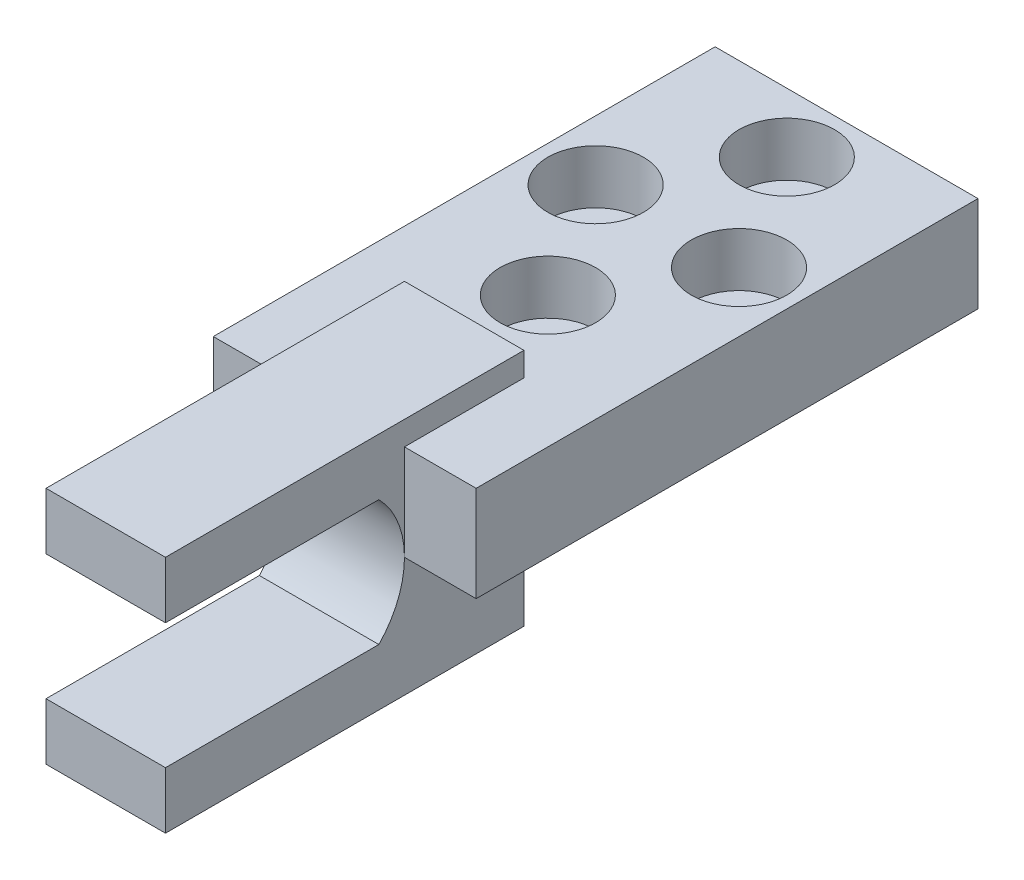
ISO-10303-21;
HEADER;
FILE_DESCRIPTION(('STEP AP214'),'2;1');
FILE_NAME('part.step','',(''),(''),'','','');
FILE_SCHEMA(('AUTOMOTIVE_DESIGN { 1 0 10303 214 1 1 1 1 }'));
ENDSEC;
DATA;
#1=APPLICATION_CONTEXT('core data for automotive mechanical design processes');
#2=APPLICATION_PROTOCOL_DEFINITION('international standard','automotive_design',2000,#1);
#3=PRODUCT_CONTEXT('',#1,'mechanical');
#4=PRODUCT('Part','Part','',(#3));
#5=PRODUCT_RELATED_PRODUCT_CATEGORY('part','',(#4));
#6=PRODUCT_DEFINITION_FORMATION('','',#4);
#7=PRODUCT_DEFINITION_CONTEXT('part definition',#1,'design');
#8=PRODUCT_DEFINITION('design','',#6,#7);
#9=PRODUCT_DEFINITION_SHAPE('','',#8);
#10=(LENGTH_UNIT() NAMED_UNIT(*) SI_UNIT(.MILLI.,.METRE.));
#11=(NAMED_UNIT(*) PLANE_ANGLE_UNIT() SI_UNIT($,.RADIAN.));
#12=(NAMED_UNIT(*) SI_UNIT($,.STERADIAN.) SOLID_ANGLE_UNIT());
#13=UNCERTAINTY_MEASURE_WITH_UNIT(LENGTH_MEASURE(1.E-05),#10,'distance_accuracy_value','');
#14=(GEOMETRIC_REPRESENTATION_CONTEXT(3) GLOBAL_UNCERTAINTY_ASSIGNED_CONTEXT((#13)) GLOBAL_UNIT_ASSIGNED_CONTEXT((#10,
#11,#12)) REPRESENTATION_CONTEXT('',''));
#15=CARTESIAN_POINT('',(0.,0.,0.));
#16=DIRECTION('',(0.,0.,1.));
#17=DIRECTION('',(1.,0.,0.));
#18=AXIS2_PLACEMENT_3D('',#15,#16,#17);
#19=CARTESIAN_POINT('',(17.,-44.0000000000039,15.));
#20=DIRECTION('',(0.,1.,0.));
#21=DIRECTION('',(-1.,0.,0.));
#22=AXIS2_PLACEMENT_3D('',#19,#20,#21);
#23=CYLINDRICAL_SURFACE('',#22,2.25);
#24=CARTESIAN_POINT('',(17.,9.99999999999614,15.));
#25=DIRECTION('',(0.,1.,0.));
#26=DIRECTION('',(0.,0.,1.));
#27=AXIS2_PLACEMENT_3D('',#24,#25,#26);
#28=CIRCLE('',#27,2.25);
#29=CARTESIAN_POINT('',(17.,9.99999999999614,17.25));
#30=VERTEX_POINT('',#29);
#31=EDGE_CURVE('E184',#30,#30,#28,.T.);
#32=ORIENTED_EDGE('',*,*,#31,.F.);
#33=EDGE_LOOP('',(#32));
#34=FACE_BOUND('',#33,.T.);
#35=CARTESIAN_POINT('',(17.,13.4999999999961,15.));
#36=DIRECTION('',(0.,1.,0.));
#37=DIRECTION('',(-1.,0.,0.));
#38=AXIS2_PLACEMENT_3D('',#35,#36,#37);
#39=CIRCLE('',#38,2.25);
#40=CARTESIAN_POINT('',(14.75,13.4999999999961,15.));
#41=VERTEX_POINT('',#40);
#42=EDGE_CURVE('E196',#41,#41,#39,.F.);
#43=ORIENTED_EDGE('',*,*,#42,.F.);
#44=EDGE_LOOP('',(#43));
#45=FACE_BOUND('',#44,.T.);
#46=ADVANCED_FACE('F33',(#34,#45),#23,.F.);
#47=CARTESIAN_POINT('',(4.99999999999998,-44.0000000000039,15.));
#48=DIRECTION('',(0.,1.,0.));
#49=DIRECTION('',(-1.,0.,0.));
#50=AXIS2_PLACEMENT_3D('',#47,#48,#49);
#51=CYLINDRICAL_SURFACE('',#50,2.25);
#52=CARTESIAN_POINT('',(5.00000000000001,9.99999999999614,15.));
#53=DIRECTION('',(0.,1.,0.));
#54=DIRECTION('',(0.,0.,1.));
#55=AXIS2_PLACEMENT_3D('',#52,#53,#54);
#56=CIRCLE('',#55,2.25);
#57=CARTESIAN_POINT('',(5.00000000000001,9.99999999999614,17.25));
#58=VERTEX_POINT('',#57);
#59=EDGE_CURVE('E330',#58,#58,#56,.T.);
#60=ORIENTED_EDGE('',*,*,#59,.F.);
#61=EDGE_LOOP('',(#60));
#62=FACE_BOUND('',#61,.T.);
#63=CARTESIAN_POINT('',(5.00000000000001,13.4999999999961,15.));
#64=DIRECTION('',(0.,1.,0.));
#65=DIRECTION('',(-1.,0.,0.));
#66=AXIS2_PLACEMENT_3D('',#63,#64,#65);
#67=CIRCLE('',#66,2.25);
#68=CARTESIAN_POINT('',(2.75000000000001,13.4999999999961,15.));
#69=VERTEX_POINT('',#68);
#70=EDGE_CURVE('E191',#69,#69,#67,.F.);
#71=ORIENTED_EDGE('',*,*,#70,.F.);
#72=EDGE_LOOP('',(#71));
#73=FACE_BOUND('',#72,.T.);
#74=ADVANCED_FACE('F389',(#62,#73),#51,.F.);
#75=CARTESIAN_POINT('',(11.,-44.0000000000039,25.));
#76=DIRECTION('',(0.,1.,0.));
#77=DIRECTION('',(-1.,0.,0.));
#78=AXIS2_PLACEMENT_3D('',#75,#76,#77);
#79=CYLINDRICAL_SURFACE('',#78,2.25);
#80=CARTESIAN_POINT('',(11.,9.99999999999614,25.));
#81=DIRECTION('',(0.,1.,0.));
#82=DIRECTION('',(0.,0.,1.));
#83=AXIS2_PLACEMENT_3D('',#80,#81,#82);
#84=CIRCLE('',#83,2.25);
#85=CARTESIAN_POINT('',(11.,9.99999999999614,27.25));
#86=VERTEX_POINT('',#85);
#87=EDGE_CURVE('E327',#86,#86,#84,.T.);
#88=ORIENTED_EDGE('',*,*,#87,.F.);
#89=EDGE_LOOP('',(#88));
#90=FACE_BOUND('',#89,.T.);
#91=CARTESIAN_POINT('',(11.,13.4999999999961,25.));
#92=DIRECTION('',(0.,1.,0.));
#93=DIRECTION('',(-1.,0.,0.));
#94=AXIS2_PLACEMENT_3D('',#91,#92,#93);
#95=CIRCLE('',#94,2.25);
#96=CARTESIAN_POINT('',(8.75000000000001,13.4999999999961,25.));
#97=VERTEX_POINT('',#96);
#98=EDGE_CURVE('E186',#97,#97,#95,.F.);
#99=ORIENTED_EDGE('',*,*,#98,.F.);
#100=EDGE_LOOP('',(#99));
#101=FACE_BOUND('',#100,.T.);
#102=ADVANCED_FACE('F395',(#90,#101),#79,.F.);
#103=CARTESIAN_POINT('',(11.,-44.0000000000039,5.));
#104=DIRECTION('',(0.,1.,0.));
#105=DIRECTION('',(-1.,0.,0.));
#106=AXIS2_PLACEMENT_3D('',#103,#104,#105);
#107=CYLINDRICAL_SURFACE('',#106,2.25);
#108=CARTESIAN_POINT('',(11.,9.99999999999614,5.));
#109=DIRECTION('',(0.,1.,0.));
#110=DIRECTION('',(0.,0.,1.));
#111=AXIS2_PLACEMENT_3D('',#108,#109,#110);
#112=CIRCLE('',#111,2.25);
#113=CARTESIAN_POINT('',(11.,9.99999999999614,7.25));
#114=VERTEX_POINT('',#113);
#115=EDGE_CURVE('E273',#114,#114,#112,.T.);
#116=ORIENTED_EDGE('',*,*,#115,.F.);
#117=EDGE_LOOP('',(#116));
#118=FACE_BOUND('',#117,.T.);
#119=CARTESIAN_POINT('',(11.,13.4999999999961,5.));
#120=DIRECTION('',(0.,1.,0.));
#121=DIRECTION('',(-1.,0.,0.));
#122=AXIS2_PLACEMENT_3D('',#119,#120,#121);
#123=CIRCLE('',#122,2.25);
#124=CARTESIAN_POINT('',(8.75000000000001,13.4999999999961,5.));
#125=VERTEX_POINT('',#124);
#126=EDGE_CURVE('E181',#125,#125,#123,.F.);
#127=ORIENTED_EDGE('',*,*,#126,.F.);
#128=EDGE_LOOP('',(#127));
#129=FACE_BOUND('',#128,.T.);
#130=ADVANCED_FACE('F406',(#118,#129),#107,.F.);
#131=CARTESIAN_POINT('',(16.,17.9999999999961,62.));
#132=DIRECTION('',(-1.,0.,0.));
#133=DIRECTION('',(0.,0.,1.));
#134=AXIS2_PLACEMENT_3D('',#131,#132,#133);
#135=PLANE('',#134);
#136=DIRECTION('',(0.,-1.,0.));
#137=VECTOR('',#136,1.);
#138=CARTESIAN_POINT('',(16.,17.9999999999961,31.9999999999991));
#139=LINE('',#138,#137);
#140=CARTESIAN_POINT('',(16.,19.9999999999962,31.9999999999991));
#141=VERTEX_POINT('',#140);
#142=CARTESIAN_POINT('',(16.,17.9999999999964,31.9999999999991));
#143=VERTEX_POINT('',#142);
#144=EDGE_CURVE('E230',#141,#143,#139,.T.);
#145=ORIENTED_EDGE('',*,*,#144,.F.);
#146=DIRECTION('',(0.,0.,-1.));
#147=VECTOR('',#146,1.);
#148=CARTESIAN_POINT('',(16.,19.999999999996,62.));
#149=LINE('',#148,#147);
#150=CARTESIAN_POINT('',(16.,19.999999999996,62.));
#151=VERTEX_POINT('',#150);
#152=EDGE_CURVE('E170',#151,#141,#149,.T.);
#153=ORIENTED_EDGE('',*,*,#152,.F.);
#154=DIRECTION('',(0.,1.,0.));
#155=VECTOR('',#154,1.);
#156=CARTESIAN_POINT('',(16.,17.9999999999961,62.));
#157=LINE('',#156,#155);
#158=CARTESIAN_POINT('',(16.,15.25,62.));
#159=VERTEX_POINT('',#158);
#160=EDGE_CURVE('E47',#159,#151,#157,.T.);
#161=ORIENTED_EDGE('',*,*,#160,.F.);
#162=DIRECTION('',(0.,0.,-1.));
#163=VECTOR('',#162,1.);
#164=CARTESIAN_POINT('',(16.,15.25,61.9999999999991));
#165=LINE('',#164,#163);
#166=CARTESIAN_POINT('',(16.,15.25,44.1439286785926));
#167=VERTEX_POINT('',#166);
#168=EDGE_CURVE('E12',#159,#167,#165,.T.);
#169=ORIENTED_EDGE('',*,*,#168,.T.);
#170=CARTESIAN_POINT('',(16.,10.,49.4999999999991));
#171=DIRECTION('',(-1.,0.,0.));
#172=DIRECTION('',(0.,0.,1.));
#173=AXIS2_PLACEMENT_3D('',#170,#171,#172);
#174=CIRCLE('',#173,7.49999999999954);
#175=CARTESIAN_POINT('',(16.,10.,41.9999999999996));
#176=VERTEX_POINT('',#175);
#177=EDGE_CURVE('E163',#167,#176,#174,.T.);
#178=ORIENTED_EDGE('',*,*,#177,.T.);
#179=DIRECTION('',(0.,-1.,0.));
#180=VECTOR('',#179,1.);
#181=CARTESIAN_POINT('',(16.,19.9999999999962,41.9999999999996));
#182=LINE('',#181,#180);
#183=CARTESIAN_POINT('',(16.,17.9999999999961,41.9999999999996));
#184=VERTEX_POINT('',#183);
#185=EDGE_CURVE('E150',#184,#176,#182,.T.);
#186=ORIENTED_EDGE('',*,*,#185,.F.);
#187=DIRECTION('',(0.,0.,-1.));
#188=VECTOR('',#187,1.);
#189=CARTESIAN_POINT('',(16.,17.9999999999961,62.));
#190=LINE('',#189,#188);
#191=EDGE_CURVE('E160',#184,#143,#190,.T.);
#192=ORIENTED_EDGE('',*,*,#191,.T.);
#193=EDGE_LOOP('',(#145,#153,#161,#169,#178,#186,#192));
#194=FACE_BOUND('',#193,.T.);
#195=ADVANCED_FACE('F35',(#194),#135,.F.);
#196=CARTESIAN_POINT('',(6.,19.999999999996,62.));
#197=DIRECTION('',(0.,-1.,0.));
#198=DIRECTION('',(0.,0.,-1.));
#199=AXIS2_PLACEMENT_3D('',#196,#197,#198);
#200=PLANE('',#199);
#201=DIRECTION('',(1.,0.,0.));
#202=VECTOR('',#201,1.);
#203=CARTESIAN_POINT('',(-40.,19.9999999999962,31.9999999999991));
#204=LINE('',#203,#202);
#205=CARTESIAN_POINT('',(6.,19.9999999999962,31.9999999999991));
#206=VERTEX_POINT('',#205);
#207=EDGE_CURVE('E265',#206,#141,#204,.T.);
#208=ORIENTED_EDGE('',*,*,#207,.F.);
#209=DIRECTION('',(0.,0.,-1.));
#210=VECTOR('',#209,1.);
#211=CARTESIAN_POINT('',(6.,19.999999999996,62.));
#212=LINE('',#211,#210);
#213=CARTESIAN_POINT('',(6.,19.999999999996,62.));
#214=VERTEX_POINT('',#213);
#215=EDGE_CURVE('E175',#214,#206,#212,.T.);
#216=ORIENTED_EDGE('',*,*,#215,.F.);
#217=DIRECTION('',(-1.,0.,0.));
#218=VECTOR('',#217,1.);
#219=CARTESIAN_POINT('',(6.,19.999999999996,62.));
#220=LINE('',#219,#218);
#221=EDGE_CURVE('E212',#151,#214,#220,.T.);
#222=ORIENTED_EDGE('',*,*,#221,.F.);
#223=ORIENTED_EDGE('',*,*,#152,.T.);
#224=EDGE_LOOP('',(#208,#216,#222,#223));
#225=FACE_BOUND('',#224,.T.);
#226=ADVANCED_FACE('F268',(#225),#200,.F.);
#227=CARTESIAN_POINT('',(6.,17.9999999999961,62.));
#228=DIRECTION('',(1.,0.,0.));
#229=DIRECTION('',(0.,1.,0.));
#230=AXIS2_PLACEMENT_3D('',#227,#228,#229);
#231=PLANE('',#230);
#232=DIRECTION('',(0.,0.,-1.));
#233=VECTOR('',#232,1.);
#234=CARTESIAN_POINT('',(6.,17.9999999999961,62.));
#235=LINE('',#234,#233);
#236=CARTESIAN_POINT('',(6.,17.9999999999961,41.9999999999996));
#237=VERTEX_POINT('',#236);
#238=CARTESIAN_POINT('',(6.,17.9999999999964,31.9999999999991));
#239=VERTEX_POINT('',#238);
#240=EDGE_CURVE('E256',#237,#239,#235,.T.);
#241=ORIENTED_EDGE('',*,*,#240,.F.);
#242=DIRECTION('',(0.,-1.,0.));
#243=VECTOR('',#242,1.);
#244=CARTESIAN_POINT('',(6.,19.9999999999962,41.9999999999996));
#245=LINE('',#244,#243);
#246=CARTESIAN_POINT('',(6.,10.,41.9999999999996));
#247=VERTEX_POINT('',#246);
#248=EDGE_CURVE('E157',#237,#247,#245,.T.);
#249=ORIENTED_EDGE('',*,*,#248,.T.);
#250=CARTESIAN_POINT('',(6.,10.,49.4999999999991));
#251=DIRECTION('',(1.,0.,0.));
#252=DIRECTION('',(0.,0.,-1.));
#253=AXIS2_PLACEMENT_3D('',#250,#251,#252);
#254=CIRCLE('',#253,7.49999999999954);
#255=CARTESIAN_POINT('',(6.,15.25,44.1439286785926));
#256=VERTEX_POINT('',#255);
#257=EDGE_CURVE('E55',#247,#256,#254,.T.);
#258=ORIENTED_EDGE('',*,*,#257,.T.);
#259=DIRECTION('',(0.,0.,1.));
#260=VECTOR('',#259,1.);
#261=CARTESIAN_POINT('',(6.,15.25,61.9999999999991));
#262=LINE('',#261,#260);
#263=CARTESIAN_POINT('',(6.,15.25,62.));
#264=VERTEX_POINT('',#263);
#265=EDGE_CURVE('E41',#256,#264,#262,.T.);
#266=ORIENTED_EDGE('',*,*,#265,.T.);
#267=DIRECTION('',(0.,-1.,0.));
#268=VECTOR('',#267,1.);
#269=CARTESIAN_POINT('',(6.,17.9999999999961,62.));
#270=LINE('',#269,#268);
#271=EDGE_CURVE('E204',#214,#264,#270,.T.);
#272=ORIENTED_EDGE('',*,*,#271,.F.);
#273=ORIENTED_EDGE('',*,*,#215,.T.);
#274=DIRECTION('',(0.,1.,0.));
#275=VECTOR('',#274,1.);
#276=CARTESIAN_POINT('',(6.,17.9999999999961,31.9999999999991));
#277=LINE('',#276,#275);
#278=EDGE_CURVE('E259',#239,#206,#277,.T.);
#279=ORIENTED_EDGE('',*,*,#278,.F.);
#280=EDGE_LOOP('',(#241,#249,#258,#266,#272,#273,#279));
#281=FACE_BOUND('',#280,.T.);
#282=ADVANCED_FACE('F203',(#281),#231,.F.);
#283=CARTESIAN_POINT('',(0.,9.99999999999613,62.));
#284=DIRECTION('',(1.,0.,0.));
#285=DIRECTION('',(0.,0.,-1.));
#286=AXIS2_PLACEMENT_3D('',#283,#284,#285);
#287=PLANE('',#286);
#288=DIRECTION('',(0.,0.,-1.));
#289=VECTOR('',#288,1.);
#290=CARTESIAN_POINT('',(0.,9.99999999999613,62.));
#291=LINE('',#290,#289);
#292=CARTESIAN_POINT('',(0.,10.,41.9999999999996));
#293=VERTEX_POINT('',#292);
#294=CARTESIAN_POINT('',(0.,9.99999999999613,0.));
#295=VERTEX_POINT('',#294);
#296=EDGE_CURVE('E252',#293,#295,#291,.T.);
#297=ORIENTED_EDGE('',*,*,#296,.F.);
#298=DIRECTION('',(0.,1.,0.));
#299=VECTOR('',#298,1.);
#300=CARTESIAN_POINT('',(0.,9.99999999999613,41.9999999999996));
#301=LINE('',#300,#299);
#302=CARTESIAN_POINT('',(0.,17.9999999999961,41.9999999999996));
#303=VERTEX_POINT('',#302);
#304=EDGE_CURVE('E355',#293,#303,#301,.T.);
#305=ORIENTED_EDGE('',*,*,#304,.T.);
#306=DIRECTION('',(0.,0.,-1.));
#307=VECTOR('',#306,1.);
#308=CARTESIAN_POINT('',(0.,17.9999999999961,62.));
#309=LINE('',#308,#307);
#310=CARTESIAN_POINT('',(0.,17.9999999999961,0.));
#311=VERTEX_POINT('',#310);
#312=EDGE_CURVE('E254',#303,#311,#309,.T.);
#313=ORIENTED_EDGE('',*,*,#312,.T.);
#314=DIRECTION('',(0.,-1.,0.));
#315=VECTOR('',#314,1.);
#316=CARTESIAN_POINT('',(0.,9.99999999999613,0.));
#317=LINE('',#316,#315);
#318=EDGE_CURVE('E229',#311,#295,#317,.T.);
#319=ORIENTED_EDGE('',*,*,#318,.T.);
#320=EDGE_LOOP('',(#297,#305,#313,#319));
#321=FACE_BOUND('',#320,.T.);
#322=ADVANCED_FACE('F373',(#321),#287,.F.);
#323=CARTESIAN_POINT('',(6.,-2.27373675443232E-13,62.));
#324=DIRECTION('',(1.,0.,0.));
#325=DIRECTION('',(0.,0.,-1.));
#326=AXIS2_PLACEMENT_3D('',#323,#324,#325);
#327=PLANE('',#326);
#328=DIRECTION('',(0.,1.,0.));
#329=VECTOR('',#328,1.);
#330=CARTESIAN_POINT('',(6.,-2.27373675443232E-13,31.9999999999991));
#331=LINE('',#330,#329);
#332=CARTESIAN_POINT('',(6.,0.,31.9999999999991));
#333=VERTEX_POINT('',#332);
#334=CARTESIAN_POINT('',(6.,9.99999999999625,31.9999999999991));
#335=VERTEX_POINT('',#334);
#336=EDGE_CURVE('E266',#333,#335,#331,.T.);
#337=ORIENTED_EDGE('',*,*,#336,.F.);
#338=DIRECTION('',(0.,0.,-1.));
#339=VECTOR('',#338,1.);
#340=CARTESIAN_POINT('',(6.,-2.27373675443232E-13,62.));
#341=LINE('',#340,#339);
#342=CARTESIAN_POINT('',(6.,-2.27373675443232E-13,62.));
#343=VERTEX_POINT('',#342);
#344=EDGE_CURVE('E247',#343,#333,#341,.T.);
#345=ORIENTED_EDGE('',*,*,#344,.F.);
#346=DIRECTION('',(0.,-1.,0.));
#347=VECTOR('',#346,1.);
#348=CARTESIAN_POINT('',(6.,-2.27373675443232E-13,62.));
#349=LINE('',#348,#347);
#350=CARTESIAN_POINT('',(6.,4.75,61.9999999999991));
#351=VERTEX_POINT('',#350);
#352=EDGE_CURVE('E214',#351,#343,#349,.T.);
#353=ORIENTED_EDGE('',*,*,#352,.F.);
#354=DIRECTION('',(0.,0.,1.));
#355=VECTOR('',#354,1.);
#356=CARTESIAN_POINT('',(6.,4.75,62.));
#357=LINE('',#356,#355);
#358=CARTESIAN_POINT('',(6.,4.75,44.1439286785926));
#359=VERTEX_POINT('',#358);
#360=EDGE_CURVE('E279',#359,#351,#357,.T.);
#361=ORIENTED_EDGE('',*,*,#360,.F.);
#362=CARTESIAN_POINT('',(6.,10.,49.4999999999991));
#363=DIRECTION('',(1.,0.,0.));
#364=DIRECTION('',(0.,0.,-1.));
#365=AXIS2_PLACEMENT_3D('',#362,#363,#364);
#366=CIRCLE('',#365,7.49999999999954);
#367=EDGE_CURVE('E286',#247,#359,#366,.F.);
#368=ORIENTED_EDGE('',*,*,#367,.F.);
#369=DIRECTION('',(0.,0.,-1.));
#370=VECTOR('',#369,1.);
#371=CARTESIAN_POINT('',(6.,9.99999999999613,62.));
#372=LINE('',#371,#370);
#373=EDGE_CURVE('E249',#247,#335,#372,.T.);
#374=ORIENTED_EDGE('',*,*,#373,.T.);
#375=EDGE_LOOP('',(#337,#345,#353,#361,#368,#374));
#376=FACE_BOUND('',#375,.T.);
#377=ADVANCED_FACE('F312',(#376),#327,.F.);
#378=CARTESIAN_POINT('',(6.,-2.27373675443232E-13,62.));
#379=DIRECTION('',(0.,1.,0.));
#380=DIRECTION('',(0.,0.,1.));
#381=AXIS2_PLACEMENT_3D('',#378,#379,#380);
#382=PLANE('',#381);
#383=DIRECTION('',(1.,0.,0.));
#384=VECTOR('',#383,1.);
#385=CARTESIAN_POINT('',(-40.,0.,31.9999999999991));
#386=LINE('',#385,#384);
#387=CARTESIAN_POINT('',(16.,0.,31.9999999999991));
#388=VERTEX_POINT('',#387);
#389=EDGE_CURVE('E301',#333,#388,#386,.T.);
#390=ORIENTED_EDGE('',*,*,#389,.T.);
#391=DIRECTION('',(0.,0.,-1.));
#392=VECTOR('',#391,1.);
#393=CARTESIAN_POINT('',(16.,-2.27373675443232E-13,62.));
#394=LINE('',#393,#392);
#395=CARTESIAN_POINT('',(16.,-2.27373675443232E-13,62.));
#396=VERTEX_POINT('',#395);
#397=EDGE_CURVE('E245',#396,#388,#394,.T.);
#398=ORIENTED_EDGE('',*,*,#397,.F.);
#399=DIRECTION('',(1.,0.,0.));
#400=VECTOR('',#399,1.);
#401=CARTESIAN_POINT('',(6.,-2.27373675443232E-13,62.));
#402=LINE('',#401,#400);
#403=EDGE_CURVE('E216',#343,#396,#402,.T.);
#404=ORIENTED_EDGE('',*,*,#403,.F.);
#405=ORIENTED_EDGE('',*,*,#344,.T.);
#406=EDGE_LOOP('',(#390,#398,#404,#405));
#407=FACE_BOUND('',#406,.T.);
#408=ADVANCED_FACE('F436',(#407),#382,.F.);
#409=CARTESIAN_POINT('',(16.,-2.27373675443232E-13,62.));
#410=DIRECTION('',(-1.,0.,0.));
#411=DIRECTION('',(0.,0.,1.));
#412=AXIS2_PLACEMENT_3D('',#409,#410,#411);
#413=PLANE('',#412);
#414=DIRECTION('',(0.,0.,-1.));
#415=VECTOR('',#414,1.);
#416=CARTESIAN_POINT('',(16.,9.99999999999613,62.));
#417=LINE('',#416,#415);
#418=CARTESIAN_POINT('',(16.,9.99999999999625,31.9999999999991));
#419=VERTEX_POINT('',#418);
#420=EDGE_CURVE('E242',#176,#419,#417,.T.);
#421=ORIENTED_EDGE('',*,*,#420,.F.);
#422=CARTESIAN_POINT('',(16.,10.,49.4999999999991));
#423=DIRECTION('',(-1.,0.,0.));
#424=DIRECTION('',(0.,0.,1.));
#425=AXIS2_PLACEMENT_3D('',#422,#423,#424);
#426=CIRCLE('',#425,7.49999999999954);
#427=CARTESIAN_POINT('',(16.,4.75,44.1439286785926));
#428=VERTEX_POINT('',#427);
#429=EDGE_CURVE('E284',#428,#176,#426,.F.);
#430=ORIENTED_EDGE('',*,*,#429,.F.);
#431=DIRECTION('',(0.,0.,-1.));
#432=VECTOR('',#431,1.);
#433=CARTESIAN_POINT('',(16.,4.75,62.));
#434=LINE('',#433,#432);
#435=CARTESIAN_POINT('',(16.,4.75,61.9999999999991));
#436=VERTEX_POINT('',#435);
#437=EDGE_CURVE('E277',#436,#428,#434,.T.);
#438=ORIENTED_EDGE('',*,*,#437,.F.);
#439=DIRECTION('',(0.,1.,0.));
#440=VECTOR('',#439,1.);
#441=CARTESIAN_POINT('',(16.,-2.27373675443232E-13,62.));
#442=LINE('',#441,#440);
#443=EDGE_CURVE('E222',#396,#436,#442,.T.);
#444=ORIENTED_EDGE('',*,*,#443,.F.);
#445=ORIENTED_EDGE('',*,*,#397,.T.);
#446=DIRECTION('',(0.,-1.,0.));
#447=VECTOR('',#446,1.);
#448=CARTESIAN_POINT('',(16.,-2.27373675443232E-13,31.9999999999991));
#449=LINE('',#448,#447);
#450=EDGE_CURVE('E290',#419,#388,#449,.T.);
#451=ORIENTED_EDGE('',*,*,#450,.F.);
#452=EDGE_LOOP('',(#421,#430,#438,#444,#445,#451));
#453=FACE_BOUND('',#452,.T.);
#454=ADVANCED_FACE('F432',(#453),#413,.F.);
#455=CARTESIAN_POINT('',(16.,9.99999999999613,62.));
#456=DIRECTION('',(0.,1.,0.));
#457=DIRECTION('',(0.,0.,1.));
#458=AXIS2_PLACEMENT_3D('',#455,#456,#457);
#459=PLANE('',#458);
#460=ORIENTED_EDGE('',*,*,#31,.T.);
#461=EDGE_LOOP('',(#460));
#462=FACE_BOUND('',#461,.T.);
#463=ORIENTED_EDGE('',*,*,#59,.T.);
#464=EDGE_LOOP('',(#463));
#465=FACE_BOUND('',#464,.T.);
#466=ORIENTED_EDGE('',*,*,#87,.T.);
#467=EDGE_LOOP('',(#466));
#468=FACE_BOUND('',#467,.T.);
#469=ORIENTED_EDGE('',*,*,#115,.T.);
#470=EDGE_LOOP('',(#469));
#471=FACE_BOUND('',#470,.T.);
#472=DIRECTION('',(1.,0.,0.));
#473=VECTOR('',#472,1.);
#474=CARTESIAN_POINT('',(16.,9.99999999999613,0.));
#475=LINE('',#474,#473);
#476=CARTESIAN_POINT('',(22.,9.99999999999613,0.));
#477=VERTEX_POINT('',#476);
#478=EDGE_CURVE('E233',#295,#477,#475,.T.);
#479=ORIENTED_EDGE('',*,*,#478,.T.);
#480=DIRECTION('',(0.,0.,-1.));
#481=VECTOR('',#480,1.);
#482=CARTESIAN_POINT('',(22.,9.99999999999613,62.));
#483=LINE('',#482,#481);
#484=CARTESIAN_POINT('',(22.,10.,41.9999999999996));
#485=VERTEX_POINT('',#484);
#486=EDGE_CURVE('E240',#485,#477,#483,.T.);
#487=ORIENTED_EDGE('',*,*,#486,.F.);
#488=DIRECTION('',(1.,0.,0.));
#489=VECTOR('',#488,1.);
#490=CARTESIAN_POINT('',(-40.,9.99999999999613,41.9999999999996));
#491=LINE('',#490,#489);
#492=EDGE_CURVE('E282',#176,#485,#491,.T.);
#493=ORIENTED_EDGE('',*,*,#492,.F.);
#494=ORIENTED_EDGE('',*,*,#420,.T.);
#495=DIRECTION('',(1.,0.,0.));
#496=VECTOR('',#495,1.);
#497=CARTESIAN_POINT('',(-40.,9.99999999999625,31.9999999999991));
#498=LINE('',#497,#496);
#499=EDGE_CURVE('E280',#335,#419,#498,.T.);
#500=ORIENTED_EDGE('',*,*,#499,.F.);
#501=ORIENTED_EDGE('',*,*,#373,.F.);
#502=DIRECTION('',(1.,0.,0.));
#503=VECTOR('',#502,1.);
#504=CARTESIAN_POINT('',(-40.,9.99999999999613,41.9999999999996));
#505=LINE('',#504,#503);
#506=EDGE_CURVE('E288',#293,#247,#505,.T.);
#507=ORIENTED_EDGE('',*,*,#506,.F.);
#508=ORIENTED_EDGE('',*,*,#296,.T.);
#509=EDGE_LOOP('',(#479,#487,#493,#494,#500,#501,#507,#508));
#510=FACE_BOUND('',#509,.T.);
#511=ADVANCED_FACE('F306',(#462,#465,#468,#471,#510),#459,.F.);
#512=CARTESIAN_POINT('',(22.,9.99999999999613,62.));
#513=DIRECTION('',(-1.,0.,0.));
#514=DIRECTION('',(0.,0.,1.));
#515=AXIS2_PLACEMENT_3D('',#512,#513,#514);
#516=PLANE('',#515);
#517=DIRECTION('',(0.,0.,-1.));
#518=VECTOR('',#517,1.);
#519=CARTESIAN_POINT('',(22.,17.9999999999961,62.));
#520=LINE('',#519,#518);
#521=CARTESIAN_POINT('',(22.,17.9999999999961,41.9999999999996));
#522=VERTEX_POINT('',#521);
#523=CARTESIAN_POINT('',(22.,17.9999999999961,0.));
#524=VERTEX_POINT('',#523);
#525=EDGE_CURVE('E225',#522,#524,#520,.T.);
#526=ORIENTED_EDGE('',*,*,#525,.F.);
#527=DIRECTION('',(0.,-1.,0.));
#528=VECTOR('',#527,1.);
#529=CARTESIAN_POINT('',(22.,9.99999999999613,41.9999999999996));
#530=LINE('',#529,#528);
#531=EDGE_CURVE('E153',#522,#485,#530,.T.);
#532=ORIENTED_EDGE('',*,*,#531,.T.);
#533=ORIENTED_EDGE('',*,*,#486,.T.);
#534=DIRECTION('',(0.,1.,0.));
#535=VECTOR('',#534,1.);
#536=CARTESIAN_POINT('',(22.,9.99999999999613,0.));
#537=LINE('',#536,#535);
#538=EDGE_CURVE('E236',#477,#524,#537,.T.);
#539=ORIENTED_EDGE('',*,*,#538,.T.);
#540=EDGE_LOOP('',(#526,#532,#533,#539));
#541=FACE_BOUND('',#540,.T.);
#542=ADVANCED_FACE('F363',(#541),#516,.F.);
#543=CARTESIAN_POINT('',(22.,17.9999999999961,62.));
#544=DIRECTION('',(0.,0.,1.));
#545=DIRECTION('',(1.,0.,0.));
#546=AXIS2_PLACEMENT_3D('',#543,#544,#545);
#547=PLANE('',#546);
#548=ORIENTED_EDGE('',*,*,#443,.T.);
#549=DIRECTION('',(-1.,0.,0.));
#550=VECTOR('',#549,1.);
#551=CARTESIAN_POINT('',(22.,4.75,62.));
#552=LINE('',#551,#550);
#553=EDGE_CURVE('E173',#436,#351,#552,.T.);
#554=ORIENTED_EDGE('',*,*,#553,.T.);
#555=ORIENTED_EDGE('',*,*,#352,.T.);
#556=ORIENTED_EDGE('',*,*,#403,.T.);
#557=EDGE_LOOP('',(#548,#554,#555,#556));
#558=FACE_BOUND('',#557,.T.);
#559=ADVANCED_FACE('F422',(#558),#547,.T.);
#560=DIRECTION('',(1.,0.,0.));
#561=VECTOR('',#560,1.);
#562=CARTESIAN_POINT('',(22.,15.25,62.));
#563=LINE('',#562,#561);
#564=EDGE_CURVE('E169',#264,#159,#563,.T.);
#565=ORIENTED_EDGE('',*,*,#564,.T.);
#566=ORIENTED_EDGE('',*,*,#160,.T.);
#567=ORIENTED_EDGE('',*,*,#221,.T.);
#568=ORIENTED_EDGE('',*,*,#271,.T.);
#569=EDGE_LOOP('',(#565,#566,#567,#568));
#570=FACE_BOUND('',#569,.T.);
#571=ADVANCED_FACE('F210',(#570),#547,.T.);
#572=CARTESIAN_POINT('',(22.,17.9999999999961,0.));
#573=DIRECTION('',(0.,0.,1.));
#574=DIRECTION('',(1.,0.,0.));
#575=AXIS2_PLACEMENT_3D('',#572,#573,#574);
#576=PLANE('',#575);
#577=ORIENTED_EDGE('',*,*,#478,.F.);
#578=ORIENTED_EDGE('',*,*,#318,.F.);
#579=DIRECTION('',(-1.,0.,0.));
#580=VECTOR('',#579,1.);
#581=CARTESIAN_POINT('',(0.,17.9999999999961,0.));
#582=LINE('',#581,#580);
#583=EDGE_CURVE('E226',#524,#311,#582,.T.);
#584=ORIENTED_EDGE('',*,*,#583,.F.);
#585=ORIENTED_EDGE('',*,*,#538,.F.);
#586=EDGE_LOOP('',(#577,#578,#584,#585));
#587=FACE_BOUND('',#586,.T.);
#588=ADVANCED_FACE('F370',(#587),#576,.F.);
#589=CARTESIAN_POINT('',(0.,17.9999999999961,62.));
#590=DIRECTION('',(0.,-1.,0.));
#591=DIRECTION('',(1.,0.,0.));
#592=AXIS2_PLACEMENT_3D('',#589,#590,#591);
#593=PLANE('',#592);
#594=CARTESIAN_POINT('',(17.,17.9999999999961,15.));
#595=DIRECTION('',(0.,1.,0.));
#596=DIRECTION('',(-1.,0.,0.));
#597=AXIS2_PLACEMENT_3D('',#594,#595,#596);
#598=CIRCLE('',#597,4.);
#599=CARTESIAN_POINT('',(13.,17.9999999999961,15.));
#600=VERTEX_POINT('',#599);
#601=EDGE_CURVE('E347',#600,#600,#598,.T.);
#602=ORIENTED_EDGE('',*,*,#601,.F.);
#603=EDGE_LOOP('',(#602));
#604=FACE_BOUND('',#603,.T.);
#605=CARTESIAN_POINT('',(5.00000000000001,17.9999999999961,15.));
#606=DIRECTION('',(0.,1.,0.));
#607=DIRECTION('',(-1.,0.,0.));
#608=AXIS2_PLACEMENT_3D('',#605,#606,#607);
#609=CIRCLE('',#608,4.);
#610=CARTESIAN_POINT('',(1.00000000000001,17.9999999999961,15.));
#611=VERTEX_POINT('',#610);
#612=EDGE_CURVE('E198',#611,#611,#609,.T.);
#613=ORIENTED_EDGE('',*,*,#612,.F.);
#614=EDGE_LOOP('',(#613));
#615=FACE_BOUND('',#614,.T.);
#616=CARTESIAN_POINT('',(11.,17.9999999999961,25.));
#617=DIRECTION('',(0.,1.,0.));
#618=DIRECTION('',(-1.,0.,0.));
#619=AXIS2_PLACEMENT_3D('',#616,#617,#618);
#620=CIRCLE('',#619,4.);
#621=CARTESIAN_POINT('',(7.00000000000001,17.9999999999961,25.));
#622=VERTEX_POINT('',#621);
#623=EDGE_CURVE('E194',#622,#622,#620,.T.);
#624=ORIENTED_EDGE('',*,*,#623,.F.);
#625=EDGE_LOOP('',(#624));
#626=FACE_BOUND('',#625,.T.);
#627=CARTESIAN_POINT('',(11.,17.9999999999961,5.));
#628=DIRECTION('',(0.,1.,0.));
#629=DIRECTION('',(-1.,0.,0.));
#630=AXIS2_PLACEMENT_3D('',#627,#628,#629);
#631=CIRCLE('',#630,4.);
#632=CARTESIAN_POINT('',(7.00000000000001,17.9999999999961,5.));
#633=VERTEX_POINT('',#632);
#634=EDGE_CURVE('E189',#633,#633,#631,.T.);
#635=ORIENTED_EDGE('',*,*,#634,.F.);
#636=EDGE_LOOP('',(#635));
#637=FACE_BOUND('',#636,.T.);
#638=ORIENTED_EDGE('',*,*,#191,.F.);
#639=DIRECTION('',(1.,0.,0.));
#640=VECTOR('',#639,1.);
#641=CARTESIAN_POINT('',(0.,17.9999999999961,41.9999999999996));
#642=LINE('',#641,#640);
#643=EDGE_CURVE('E147',#184,#522,#642,.T.);
#644=ORIENTED_EDGE('',*,*,#643,.T.);
#645=ORIENTED_EDGE('',*,*,#525,.T.);
#646=ORIENTED_EDGE('',*,*,#583,.T.);
#647=ORIENTED_EDGE('',*,*,#312,.F.);
#648=DIRECTION('',(1.,0.,0.));
#649=VECTOR('',#648,1.);
#650=CARTESIAN_POINT('',(0.,17.9999999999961,41.9999999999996));
#651=LINE('',#650,#649);
#652=EDGE_CURVE('E350',#303,#237,#651,.T.);
#653=ORIENTED_EDGE('',*,*,#652,.T.);
#654=ORIENTED_EDGE('',*,*,#240,.T.);
#655=DIRECTION('',(1.,0.,0.));
#656=VECTOR('',#655,1.);
#657=CARTESIAN_POINT('',(-40.,17.9999999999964,31.9999999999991));
#658=LINE('',#657,#656);
#659=EDGE_CURVE('E168',#239,#143,#658,.T.);
#660=ORIENTED_EDGE('',*,*,#659,.T.);
#661=EDGE_LOOP('',(#638,#644,#645,#646,#647,#653,#654,#660));
#662=FACE_BOUND('',#661,.T.);
#663=ADVANCED_FACE('F166',(#604,#615,#626,#637,#662),#593,.F.);
#664=CARTESIAN_POINT('',(-40.,17.9999999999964,31.9999999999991));
#665=DIRECTION('',(0.,0.,-1.));
#666=DIRECTION('',(-1.,0.,0.));
#667=AXIS2_PLACEMENT_3D('',#664,#665,#666);
#668=PLANE('',#667);
#669=ORIENTED_EDGE('',*,*,#144,.T.);
#670=ORIENTED_EDGE('',*,*,#659,.F.);
#671=ORIENTED_EDGE('',*,*,#278,.T.);
#672=ORIENTED_EDGE('',*,*,#207,.T.);
#673=EDGE_LOOP('',(#669,#670,#671,#672));
#674=FACE_BOUND('',#673,.T.);
#675=ADVANCED_FACE('F264',(#674),#668,.T.);
#676=CARTESIAN_POINT('',(-40.,0.,31.9999999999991));
#677=DIRECTION('',(0.,0.,-1.));
#678=DIRECTION('',(-1.,0.,0.));
#679=AXIS2_PLACEMENT_3D('',#676,#677,#678);
#680=PLANE('',#679);
#681=ORIENTED_EDGE('',*,*,#336,.T.);
#682=ORIENTED_EDGE('',*,*,#499,.T.);
#683=ORIENTED_EDGE('',*,*,#450,.T.);
#684=ORIENTED_EDGE('',*,*,#389,.F.);
#685=EDGE_LOOP('',(#681,#682,#683,#684));
#686=FACE_BOUND('',#685,.T.);
#687=ADVANCED_FACE('F298',(#686),#680,.T.);
#688=CARTESIAN_POINT('',(-40.,10.,49.4999999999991));
#689=DIRECTION('',(1.,0.,0.));
#690=DIRECTION('',(0.,0.,-1.));
#691=AXIS2_PLACEMENT_3D('',#688,#689,#690);
#692=CYLINDRICAL_SURFACE('',#691,7.49999999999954);
#693=ORIENTED_EDGE('',*,*,#177,.F.);
#694=DIRECTION('',(1.,0.,0.));
#695=VECTOR('',#694,1.);
#696=CARTESIAN_POINT('',(-40.,15.25,44.1439286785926));
#697=LINE('',#696,#695);
#698=EDGE_CURVE('E269',#256,#167,#697,.T.);
#699=ORIENTED_EDGE('',*,*,#698,.F.);
#700=ORIENTED_EDGE('',*,*,#257,.F.);
#701=ORIENTED_EDGE('',*,*,#367,.T.);
#702=DIRECTION('',(1.,0.,0.));
#703=VECTOR('',#702,1.);
#704=CARTESIAN_POINT('',(-40.,4.75,44.1439286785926));
#705=LINE('',#704,#703);
#706=EDGE_CURVE('E271',#359,#428,#705,.T.);
#707=ORIENTED_EDGE('',*,*,#706,.T.);
#708=ORIENTED_EDGE('',*,*,#429,.T.);
#709=EDGE_LOOP('',(#693,#699,#700,#701,#707,#708));
#710=FACE_BOUND('',#709,.T.);
#711=ADVANCED_FACE('F318',(#710),#692,.F.);
#712=CARTESIAN_POINT('',(-40.,4.75,61.9999999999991));
#713=DIRECTION('',(0.,1.,0.));
#714=DIRECTION('',(0.,0.,1.));
#715=AXIS2_PLACEMENT_3D('',#712,#713,#714);
#716=PLANE('',#715);
#717=ORIENTED_EDGE('',*,*,#360,.T.);
#718=ORIENTED_EDGE('',*,*,#553,.F.);
#719=ORIENTED_EDGE('',*,*,#437,.T.);
#720=ORIENTED_EDGE('',*,*,#706,.F.);
#721=EDGE_LOOP('',(#717,#718,#719,#720));
#722=FACE_BOUND('',#721,.T.);
#723=ADVANCED_FACE('F321',(#722),#716,.T.);
#724=CARTESIAN_POINT('',(-40.,15.25,61.9999999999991));
#725=DIRECTION('',(0.,-1.,0.));
#726=DIRECTION('',(0.,0.,-1.));
#727=AXIS2_PLACEMENT_3D('',#724,#725,#726);
#728=PLANE('',#727);
#729=ORIENTED_EDGE('',*,*,#168,.F.);
#730=ORIENTED_EDGE('',*,*,#564,.F.);
#731=ORIENTED_EDGE('',*,*,#265,.F.);
#732=ORIENTED_EDGE('',*,*,#698,.T.);
#733=EDGE_LOOP('',(#729,#730,#731,#732));
#734=FACE_BOUND('',#733,.T.);
#735=ADVANCED_FACE('F208',(#734),#728,.T.);
#736=CARTESIAN_POINT('',(11.,13.4999999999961,5.));
#737=DIRECTION('',(0.,1.,0.));
#738=DIRECTION('',(-1.,0.,0.));
#739=AXIS2_PLACEMENT_3D('',#736,#737,#738);
#740=PLANE('',#739);
#741=CARTESIAN_POINT('',(11.,13.4999999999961,5.));
#742=DIRECTION('',(0.,1.,0.));
#743=DIRECTION('',(-1.,0.,0.));
#744=AXIS2_PLACEMENT_3D('',#741,#742,#743);
#745=CIRCLE('',#744,4.);
#746=CARTESIAN_POINT('',(7.00000000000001,13.4999999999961,5.));
#747=VERTEX_POINT('',#746);
#748=EDGE_CURVE('E185',#747,#747,#745,.T.);
#749=ORIENTED_EDGE('',*,*,#748,.T.);
#750=EDGE_LOOP('',(#749));
#751=FACE_BOUND('',#750,.T.);
#752=ORIENTED_EDGE('',*,*,#126,.T.);
#753=EDGE_LOOP('',(#752));
#754=FACE_BOUND('',#753,.T.);
#755=ADVANCED_FACE('F419',(#751,#754),#740,.T.);
#756=CARTESIAN_POINT('',(11.,13.4999999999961,5.));
#757=DIRECTION('',(0.,1.,0.));
#758=DIRECTION('',(-1.,0.,0.));
#759=AXIS2_PLACEMENT_3D('',#756,#757,#758);
#760=CYLINDRICAL_SURFACE('',#759,4.);
#761=ORIENTED_EDGE('',*,*,#748,.F.);
#762=EDGE_LOOP('',(#761));
#763=FACE_BOUND('',#762,.T.);
#764=ORIENTED_EDGE('',*,*,#634,.T.);
#765=EDGE_LOOP('',(#764));
#766=FACE_BOUND('',#765,.T.);
#767=ADVANCED_FACE('F401',(#763,#766),#760,.F.);
#768=CARTESIAN_POINT('',(11.,13.4999999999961,25.));
#769=DIRECTION('',(0.,1.,0.));
#770=DIRECTION('',(-1.,0.,0.));
#771=AXIS2_PLACEMENT_3D('',#768,#769,#770);
#772=PLANE('',#771);
#773=CARTESIAN_POINT('',(11.,13.4999999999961,25.));
#774=DIRECTION('',(0.,1.,0.));
#775=DIRECTION('',(-1.,0.,0.));
#776=AXIS2_PLACEMENT_3D('',#773,#774,#775);
#777=CIRCLE('',#776,4.);
#778=CARTESIAN_POINT('',(7.00000000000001,13.4999999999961,25.));
#779=VERTEX_POINT('',#778);
#780=EDGE_CURVE('E190',#779,#779,#777,.T.);
#781=ORIENTED_EDGE('',*,*,#780,.T.);
#782=EDGE_LOOP('',(#781));
#783=FACE_BOUND('',#782,.T.);
#784=ORIENTED_EDGE('',*,*,#98,.T.);
#785=EDGE_LOOP('',(#784));
#786=FACE_BOUND('',#785,.T.);
#787=ADVANCED_FACE('F605',(#783,#786),#772,.T.);
#788=CARTESIAN_POINT('',(11.,13.4999999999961,25.));
#789=DIRECTION('',(0.,1.,0.));
#790=DIRECTION('',(-1.,0.,0.));
#791=AXIS2_PLACEMENT_3D('',#788,#789,#790);
#792=CYLINDRICAL_SURFACE('',#791,4.);
#793=ORIENTED_EDGE('',*,*,#780,.F.);
#794=EDGE_LOOP('',(#793));
#795=FACE_BOUND('',#794,.T.);
#796=ORIENTED_EDGE('',*,*,#623,.T.);
#797=EDGE_LOOP('',(#796));
#798=FACE_BOUND('',#797,.T.);
#799=ADVANCED_FACE('F596',(#795,#798),#792,.F.);
#800=CARTESIAN_POINT('',(5.00000000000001,13.4999999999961,15.));
#801=DIRECTION('',(0.,1.,0.));
#802=DIRECTION('',(-1.,0.,0.));
#803=AXIS2_PLACEMENT_3D('',#800,#801,#802);
#804=PLANE('',#803);
#805=CARTESIAN_POINT('',(5.00000000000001,13.4999999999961,15.));
#806=DIRECTION('',(0.,1.,0.));
#807=DIRECTION('',(-1.,0.,0.));
#808=AXIS2_PLACEMENT_3D('',#805,#806,#807);
#809=CIRCLE('',#808,4.);
#810=CARTESIAN_POINT('',(1.00000000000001,13.4999999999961,15.));
#811=VERTEX_POINT('',#810);
#812=EDGE_CURVE('E195',#811,#811,#809,.T.);
#813=ORIENTED_EDGE('',*,*,#812,.T.);
#814=EDGE_LOOP('',(#813));
#815=FACE_BOUND('',#814,.T.);
#816=ORIENTED_EDGE('',*,*,#70,.T.);
#817=EDGE_LOOP('',(#816));
#818=FACE_BOUND('',#817,.T.);
#819=ADVANCED_FACE('F587',(#815,#818),#804,.T.);
#820=CARTESIAN_POINT('',(5.00000000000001,13.4999999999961,15.));
#821=DIRECTION('',(0.,1.,0.));
#822=DIRECTION('',(-1.,0.,0.));
#823=AXIS2_PLACEMENT_3D('',#820,#821,#822);
#824=CYLINDRICAL_SURFACE('',#823,4.);
#825=ORIENTED_EDGE('',*,*,#812,.F.);
#826=EDGE_LOOP('',(#825));
#827=FACE_BOUND('',#826,.T.);
#828=ORIENTED_EDGE('',*,*,#612,.T.);
#829=EDGE_LOOP('',(#828));
#830=FACE_BOUND('',#829,.T.);
#831=ADVANCED_FACE('F579',(#827,#830),#824,.F.);
#832=CARTESIAN_POINT('',(17.,13.4999999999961,15.));
#833=DIRECTION('',(0.,1.,0.));
#834=DIRECTION('',(-1.,0.,0.));
#835=AXIS2_PLACEMENT_3D('',#832,#833,#834);
#836=PLANE('',#835);
#837=CARTESIAN_POINT('',(17.,13.4999999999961,15.));
#838=DIRECTION('',(0.,1.,0.));
#839=DIRECTION('',(-1.,0.,0.));
#840=AXIS2_PLACEMENT_3D('',#837,#838,#839);
#841=CIRCLE('',#840,4.);
#842=CARTESIAN_POINT('',(13.,13.4999999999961,15.));
#843=VERTEX_POINT('',#842);
#844=EDGE_CURVE('E199',#843,#843,#841,.T.);
#845=ORIENTED_EDGE('',*,*,#844,.T.);
#846=EDGE_LOOP('',(#845));
#847=FACE_BOUND('',#846,.T.);
#848=ORIENTED_EDGE('',*,*,#42,.T.);
#849=EDGE_LOOP('',(#848));
#850=FACE_BOUND('',#849,.T.);
#851=ADVANCED_FACE('F384',(#847,#850),#836,.T.);
#852=CARTESIAN_POINT('',(17.,13.4999999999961,15.));
#853=DIRECTION('',(0.,1.,0.));
#854=DIRECTION('',(-1.,0.,0.));
#855=AXIS2_PLACEMENT_3D('',#852,#853,#854);
#856=CYLINDRICAL_SURFACE('',#855,4.);
#857=ORIENTED_EDGE('',*,*,#844,.F.);
#858=EDGE_LOOP('',(#857));
#859=FACE_BOUND('',#858,.T.);
#860=ORIENTED_EDGE('',*,*,#601,.T.);
#861=EDGE_LOOP('',(#860));
#862=FACE_BOUND('',#861,.T.);
#863=ADVANCED_FACE('F377',(#859,#862),#856,.F.);
#864=CARTESIAN_POINT('',(-0.873976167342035,19.9999999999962,41.9999999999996));
#865=DIRECTION('',(0.,0.,-1.));
#866=DIRECTION('',(-1.,0.,0.));
#867=AXIS2_PLACEMENT_3D('',#864,#865,#866);
#868=PLANE('',#867);
#869=ORIENTED_EDGE('',*,*,#304,.F.);
#870=ORIENTED_EDGE('',*,*,#506,.T.);
#871=ORIENTED_EDGE('',*,*,#248,.F.);
#872=ORIENTED_EDGE('',*,*,#652,.F.);
#873=EDGE_LOOP('',(#869,#870,#871,#872));
#874=FACE_BOUND('',#873,.T.);
#875=ADVANCED_FACE('F375',(#874),#868,.F.);
#876=CARTESIAN_POINT('',(24.2709145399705,19.9999999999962,41.9999999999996));
#877=DIRECTION('',(0.,0.,-1.));
#878=DIRECTION('',(-1.,0.,0.));
#879=AXIS2_PLACEMENT_3D('',#876,#877,#878);
#880=PLANE('',#879);
#881=ORIENTED_EDGE('',*,*,#185,.T.);
#882=ORIENTED_EDGE('',*,*,#492,.T.);
#883=ORIENTED_EDGE('',*,*,#531,.F.);
#884=ORIENTED_EDGE('',*,*,#643,.F.);
#885=EDGE_LOOP('',(#881,#882,#883,#884));
#886=FACE_BOUND('',#885,.T.);
#887=ADVANCED_FACE('F149',(#886),#880,.F.);
#888=CLOSED_SHELL('',(#46,#74,#102,#130,#195,#226,#282,#322,#377,#408,#454,#511,#542,#559,#571,
#588,#663,#675,#687,#711,#723,#735,#755,#767,#787,#799,#819,#831,#851,#863,#875,#887));
#889=MANIFOLD_SOLID_BREP('B2',#888);
#890=ADVANCED_BREP_SHAPE_REPRESENTATION('',(#18,#889),#14);
#891=SHAPE_DEFINITION_REPRESENTATION(#9,#890);
ENDSEC;
END-ISO-10303-21;
